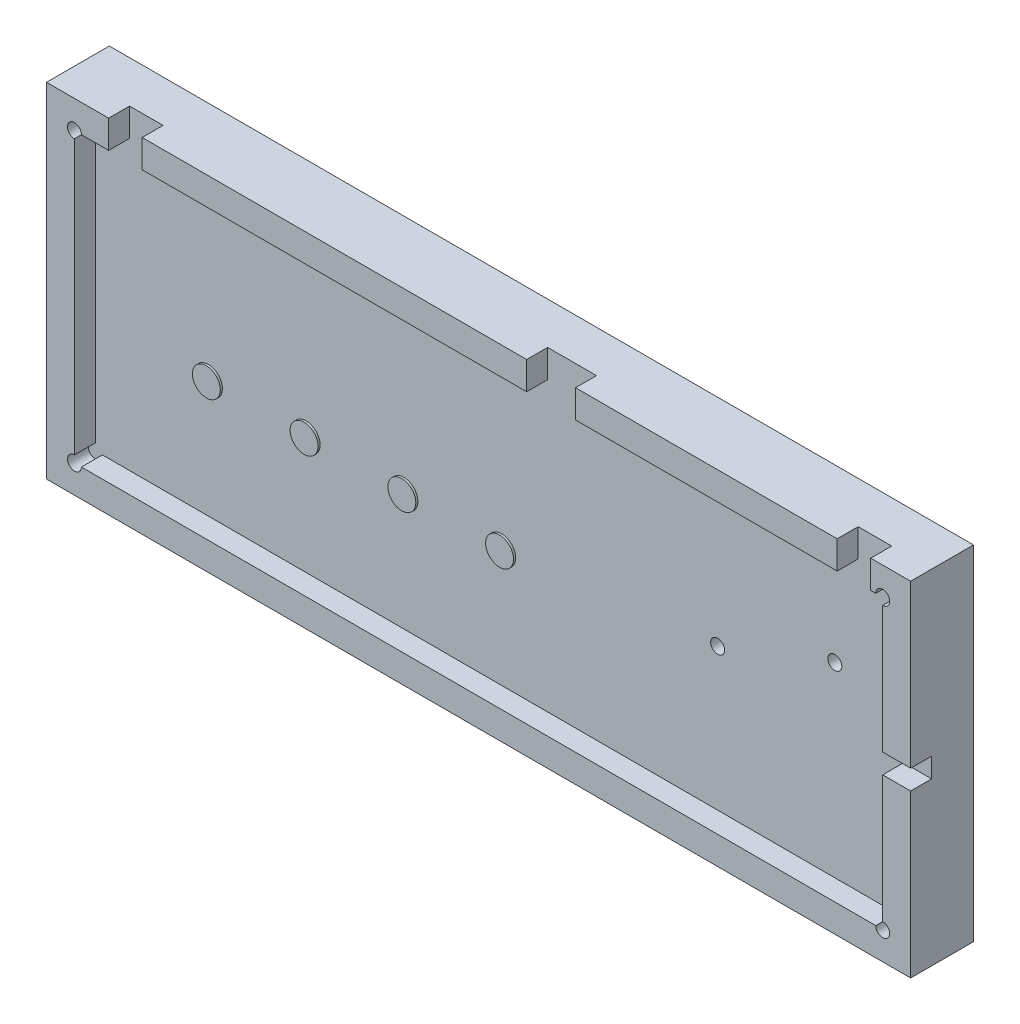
ISO-10303-21;
HEADER;
FILE_DESCRIPTION(('STEP AP214'),'2;1');
FILE_NAME('part.step','',(''),(''),'','','');
FILE_SCHEMA(('AUTOMOTIVE_DESIGN { 1 0 10303 214 1 1 1 1 }'));
ENDSEC;
DATA;
#1=APPLICATION_CONTEXT('core data for automotive mechanical design processes');
#2=APPLICATION_PROTOCOL_DEFINITION('international standard','automotive_design',2000,#1);
#3=PRODUCT_CONTEXT('',#1,'mechanical');
#4=PRODUCT('Part','Part','',(#3));
#5=PRODUCT_RELATED_PRODUCT_CATEGORY('part','',(#4));
#6=PRODUCT_DEFINITION_FORMATION('','',#4);
#7=PRODUCT_DEFINITION_CONTEXT('part definition',#1,'design');
#8=PRODUCT_DEFINITION('design','',#6,#7);
#9=PRODUCT_DEFINITION_SHAPE('','',#8);
#10=(LENGTH_UNIT() NAMED_UNIT(*) SI_UNIT(.MILLI.,.METRE.));
#11=(NAMED_UNIT(*) PLANE_ANGLE_UNIT() SI_UNIT($,.RADIAN.));
#12=(NAMED_UNIT(*) SI_UNIT($,.STERADIAN.) SOLID_ANGLE_UNIT());
#13=UNCERTAINTY_MEASURE_WITH_UNIT(LENGTH_MEASURE(1.E-05),#10,'distance_accuracy_value','');
#14=(GEOMETRIC_REPRESENTATION_CONTEXT(3) GLOBAL_UNCERTAINTY_ASSIGNED_CONTEXT((#13)) GLOBAL_UNIT_ASSIGNED_CONTEXT((#10,
#11,#12)) REPRESENTATION_CONTEXT('',''));
#15=CARTESIAN_POINT('',(0.,0.,0.));
#16=DIRECTION('',(0.,0.,1.));
#17=DIRECTION('',(1.,0.,0.));
#18=AXIS2_PLACEMENT_3D('',#15,#16,#17);
#19=CARTESIAN_POINT('',(0.,61.02,5.));
#20=DIRECTION('',(0.,0.,-1.));
#21=DIRECTION('',(-1.,0.,0.));
#22=AXIS2_PLACEMENT_3D('',#19,#20,#21);
#23=PLANE('',#22);
#24=DIRECTION('',(-1.,0.,0.));
#25=VECTOR('',#24,1.);
#26=CARTESIAN_POINT('',(9.9,51.12,5.));
#27=LINE('',#26,#25);
#28=CARTESIAN_POINT('',(74.67,51.12,5.));
#29=VERTEX_POINT('',#28);
#30=CARTESIAN_POINT('',(19.6,51.12,4.99999999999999));
#31=VERTEX_POINT('',#30);
#32=EDGE_CURVE('E233',#29,#31,#27,.T.);
#33=ORIENTED_EDGE('',*,*,#32,.F.);
#34=DIRECTION('',(0.,-1.,0.));
#35=VECTOR('',#34,1.);
#36=CARTESIAN_POINT('',(74.67,55.12,5.));
#37=LINE('',#36,#35);
#38=CARTESIAN_POINT('',(74.67,55.12,5.));
#39=VERTEX_POINT('',#38);
#40=EDGE_CURVE('E218',#39,#29,#37,.T.);
#41=ORIENTED_EDGE('',*,*,#40,.F.);
#42=DIRECTION('',(-1.,0.,0.));
#43=VECTOR('',#42,1.);
#44=CARTESIAN_POINT('',(5.9,55.12,5.));
#45=LINE('',#44,#43);
#46=CARTESIAN_POINT('',(19.6,55.12,5.));
#47=VERTEX_POINT('',#46);
#48=EDGE_CURVE('E329',#39,#47,#45,.T.);
#49=ORIENTED_EDGE('',*,*,#48,.T.);
#50=DIRECTION('',(0.,1.,0.));
#51=VECTOR('',#50,1.);
#52=CARTESIAN_POINT('',(19.6,-0.001000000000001,4.99999999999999));
#53=LINE('',#52,#51);
#54=EDGE_CURVE('E240',#31,#47,#53,.T.);
#55=ORIENTED_EDGE('',*,*,#54,.F.);
#56=EDGE_LOOP('',(#33,#41,#49,#55));
#57=FACE_BOUND('',#56,.T.);
#58=ADVANCED_FACE('F33',(#57),#23,.F.);
#59=CARTESIAN_POINT('',(9.9,51.12,2.));
#60=DIRECTION('',(0.,1.,0.));
#61=DIRECTION('',(-1.,0.,0.));
#62=AXIS2_PLACEMENT_3D('',#59,#60,#61);
#63=PLANE('',#62);
#64=DIRECTION('',(-1.,0.,0.));
#65=VECTOR('',#64,1.);
#66=CARTESIAN_POINT('',(77.09,51.12,2.));
#67=LINE('',#66,#65);
#68=CARTESIAN_POINT('',(74.67,51.12,2.));
#69=VERTEX_POINT('',#68);
#70=CARTESIAN_POINT('',(19.6,51.12,2.));
#71=VERTEX_POINT('',#70);
#72=EDGE_CURVE('E235',#69,#71,#67,.T.);
#73=ORIENTED_EDGE('',*,*,#72,.F.);
#74=DIRECTION('',(0.,0.,1.));
#75=VECTOR('',#74,1.);
#76=CARTESIAN_POINT('',(74.67,51.12,-6.06225774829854));
#77=LINE('',#76,#75);
#78=EDGE_CURVE('E221',#69,#29,#77,.T.);
#79=ORIENTED_EDGE('',*,*,#78,.T.);
#80=ORIENTED_EDGE('',*,*,#32,.T.);
#81=DIRECTION('',(0.,0.,1.));
#82=VECTOR('',#81,1.);
#83=CARTESIAN_POINT('',(19.6,51.12,1.99999999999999));
#84=LINE('',#83,#82);
#85=EDGE_CURVE('E481',#71,#31,#84,.T.);
#86=ORIENTED_EDGE('',*,*,#85,.F.);
#87=EDGE_LOOP('',(#73,#79,#80,#86));
#88=FACE_BOUND('',#87,.T.);
#89=ADVANCED_FACE('F231',(#88),#63,.F.);
#90=CARTESIAN_POINT('',(9.90000000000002,51.12,2.));
#91=DIRECTION('',(0.,0.,1.));
#92=DIRECTION('',(1.,0.,0.));
#93=AXIS2_PLACEMENT_3D('',#90,#91,#92);
#94=PLANE('',#93);
#95=CARTESIAN_POINT('',(26.0900000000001,26.7099999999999,2.));
#96=DIRECTION('',(0.,0.,1.));
#97=DIRECTION('',(1.,0.,0.));
#98=AXIS2_PLACEMENT_3D('',#95,#96,#97);
#99=CIRCLE('',#98,2.);
#100=CARTESIAN_POINT('',(28.0900000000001,26.7099999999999,2.));
#101=VERTEX_POINT('',#100);
#102=EDGE_CURVE('E374',#101,#101,#99,.T.);
#103=ORIENTED_EDGE('',*,*,#102,.F.);
#104=EDGE_LOOP('',(#103));
#105=FACE_BOUND('',#104,.T.);
#106=CARTESIAN_POINT('',(99.0221835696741,30.2259299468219,2.));
#107=DIRECTION('',(0.,0.,1.));
#108=DIRECTION('',(1.,0.,0.));
#109=AXIS2_PLACEMENT_3D('',#106,#107,#108);
#110=CIRCLE('',#109,0.999999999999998);
#111=CARTESIAN_POINT('',(100.022183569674,30.2259299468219,2.));
#112=VERTEX_POINT('',#111);
#113=EDGE_CURVE('E497',#112,#112,#110,.T.);
#114=ORIENTED_EDGE('',*,*,#113,.F.);
#115=EDGE_LOOP('',(#114));
#116=FACE_BOUND('',#115,.T.);
#117=CARTESIAN_POINT('',(115.807475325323,36.6118460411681,2.));
#118=DIRECTION('',(0.,0.,1.));
#119=DIRECTION('',(1.,0.,0.));
#120=AXIS2_PLACEMENT_3D('',#117,#118,#119);
#121=CIRCLE('',#120,0.999999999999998);
#122=CARTESIAN_POINT('',(116.807475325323,36.6118460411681,2.));
#123=VERTEX_POINT('',#122);
#124=EDGE_CURVE('E491',#123,#123,#121,.T.);
#125=ORIENTED_EDGE('',*,*,#124,.F.);
#126=EDGE_LOOP('',(#125));
#127=FACE_BOUND('',#126,.T.);
#128=DIRECTION('',(0.,1.,0.));
#129=VECTOR('',#128,1.);
#130=CARTESIAN_POINT('',(123.95,-0.001000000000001,2.00000000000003));
#131=LINE('',#130,#129);
#132=CARTESIAN_POINT('',(123.95,51.12,2.00000000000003));
#133=VERTEX_POINT('',#132);
#134=CARTESIAN_POINT('',(123.95,55.12,2.00000000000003));
#135=VERTEX_POINT('',#134);
#136=EDGE_CURVE('E470',#133,#135,#131,.T.);
#137=ORIENTED_EDGE('',*,*,#136,.T.);
#138=DIRECTION('',(-1.,0.,0.));
#139=VECTOR('',#138,1.);
#140=CARTESIAN_POINT('',(9.90000000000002,55.12,2.));
#141=LINE('',#140,#139);
#142=CARTESIAN_POINT('',(119.15,55.12,2.));
#143=VERTEX_POINT('',#142);
#144=EDGE_CURVE('E557',#135,#143,#141,.T.);
#145=ORIENTED_EDGE('',*,*,#144,.T.);
#146=DIRECTION('',(0.,1.,0.));
#147=VECTOR('',#146,1.);
#148=CARTESIAN_POINT('',(119.15,-0.001000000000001,2.00000000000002));
#149=LINE('',#148,#147);
#150=CARTESIAN_POINT('',(119.15,51.12,2.));
#151=VERTEX_POINT('',#150);
#152=EDGE_CURVE('E405',#151,#143,#149,.T.);
#153=ORIENTED_EDGE('',*,*,#152,.F.);
#154=CARTESIAN_POINT('',(81.67,51.12,2.));
#155=VERTEX_POINT('',#154);
#156=EDGE_CURVE('E272',#151,#155,#67,.T.);
#157=ORIENTED_EDGE('',*,*,#156,.T.);
#158=DIRECTION('',(0.,-1.,0.));
#159=VECTOR('',#158,1.);
#160=CARTESIAN_POINT('',(81.67,55.12,2.));
#161=LINE('',#160,#159);
#162=CARTESIAN_POINT('',(81.67,55.12,2.));
#163=VERTEX_POINT('',#162);
#164=EDGE_CURVE('E387',#163,#155,#161,.T.);
#165=ORIENTED_EDGE('',*,*,#164,.F.);
#166=DIRECTION('',(1.,0.,0.));
#167=VECTOR('',#166,1.);
#168=CARTESIAN_POINT('',(74.67,55.12,2.));
#169=LINE('',#168,#167);
#170=CARTESIAN_POINT('',(74.67,55.12,2.));
#171=VERTEX_POINT('',#170);
#172=EDGE_CURVE('E390',#171,#163,#169,.T.);
#173=ORIENTED_EDGE('',*,*,#172,.F.);
#174=DIRECTION('',(0.,1.,0.));
#175=VECTOR('',#174,1.);
#176=CARTESIAN_POINT('',(74.67,55.12,2.));
#177=LINE('',#176,#175);
#178=EDGE_CURVE('E382',#69,#171,#177,.T.);
#179=ORIENTED_EDGE('',*,*,#178,.F.);
#180=ORIENTED_EDGE('',*,*,#72,.T.);
#181=DIRECTION('',(0.,1.,0.));
#182=VECTOR('',#181,1.);
#183=CARTESIAN_POINT('',(19.6,-0.001000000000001,1.99999999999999));
#184=LINE('',#183,#182);
#185=CARTESIAN_POINT('',(19.6,55.12,2.));
#186=VERTEX_POINT('',#185);
#187=EDGE_CURVE('E483',#71,#186,#184,.T.);
#188=ORIENTED_EDGE('',*,*,#187,.T.);
#189=CARTESIAN_POINT('',(14.8,55.12,1.99999999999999));
#190=VERTEX_POINT('',#189);
#191=EDGE_CURVE('E559',#186,#190,#141,.T.);
#192=ORIENTED_EDGE('',*,*,#191,.T.);
#193=DIRECTION('',(0.,1.,0.));
#194=VECTOR('',#193,1.);
#195=CARTESIAN_POINT('',(14.8,-0.001000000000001,1.99999999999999));
#196=LINE('',#195,#194);
#197=CARTESIAN_POINT('',(14.8,51.12,2.));
#198=VERTEX_POINT('',#197);
#199=EDGE_CURVE('E412',#198,#190,#196,.T.);
#200=ORIENTED_EDGE('',*,*,#199,.F.);
#201=CARTESIAN_POINT('',(10.9,51.12,2.));
#202=VERTEX_POINT('',#201);
#203=EDGE_CURVE('E267',#198,#202,#67,.T.);
#204=ORIENTED_EDGE('',*,*,#203,.T.);
#205=CARTESIAN_POINT('',(9.9,51.12,2.));
#206=DIRECTION('',(0.,0.,1.));
#207=DIRECTION('',(1.,0.,0.));
#208=AXIS2_PLACEMENT_3D('',#205,#206,#207);
#209=CIRCLE('',#208,1.);
#210=CARTESIAN_POINT('',(9.9,50.12,2.));
#211=VERTEX_POINT('',#210);
#212=EDGE_CURVE('E409',#211,#202,#209,.F.);
#213=ORIENTED_EDGE('',*,*,#212,.F.);
#214=DIRECTION('',(0.,-1.,0.));
#215=VECTOR('',#214,1.);
#216=CARTESIAN_POINT('',(9.9,51.12,2.));
#217=LINE('',#216,#215);
#218=CARTESIAN_POINT('',(9.9,10.9,2.));
#219=VERTEX_POINT('',#218);
#220=EDGE_CURVE('E250',#211,#219,#217,.T.);
#221=ORIENTED_EDGE('',*,*,#220,.T.);
#222=CARTESIAN_POINT('',(9.9,9.9,2.));
#223=DIRECTION('',(0.,0.,1.));
#224=DIRECTION('',(1.,0.,0.));
#225=AXIS2_PLACEMENT_3D('',#222,#223,#224);
#226=CIRCLE('',#225,0.999999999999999);
#227=CARTESIAN_POINT('',(10.9,9.9,2.));
#228=VERTEX_POINT('',#227);
#229=EDGE_CURVE('E513',#228,#219,#226,.F.);
#230=ORIENTED_EDGE('',*,*,#229,.F.);
#231=DIRECTION('',(1.,0.,0.));
#232=VECTOR('',#231,1.);
#233=CARTESIAN_POINT('',(9.9,9.9,2.));
#234=LINE('',#233,#232);
#235=CARTESIAN_POINT('',(124.67,9.9,2.));
#236=VERTEX_POINT('',#235);
#237=EDGE_CURVE('E256',#228,#236,#234,.T.);
#238=ORIENTED_EDGE('',*,*,#237,.T.);
#239=CARTESIAN_POINT('',(125.67,9.9,2.));
#240=DIRECTION('',(0.,0.,1.));
#241=DIRECTION('',(1.,0.,0.));
#242=AXIS2_PLACEMENT_3D('',#239,#240,#241);
#243=CIRCLE('',#242,0.999999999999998);
#244=CARTESIAN_POINT('',(125.67,10.9,2.));
#245=VERTEX_POINT('',#244);
#246=EDGE_CURVE('E504',#245,#236,#243,.F.);
#247=ORIENTED_EDGE('',*,*,#246,.F.);
#248=DIRECTION('',(0.,1.,0.));
#249=VECTOR('',#248,1.);
#250=CARTESIAN_POINT('',(125.67,51.12,2.));
#251=LINE('',#250,#249);
#252=CARTESIAN_POINT('',(125.67,29.0976894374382,2.));
#253=VERTEX_POINT('',#252);
#254=EDGE_CURVE('E264',#245,#253,#251,.T.);
#255=ORIENTED_EDGE('',*,*,#254,.T.);
#256=DIRECTION('',(1.,0.,0.));
#257=VECTOR('',#256,1.);
#258=CARTESIAN_POINT('',(-0.001000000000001,29.0976894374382,2.));
#259=LINE('',#258,#257);
#260=CARTESIAN_POINT('',(129.67,29.0976894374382,2.));
#261=VERTEX_POINT('',#260);
#262=EDGE_CURVE('E539',#253,#261,#259,.T.);
#263=ORIENTED_EDGE('',*,*,#262,.T.);
#264=DIRECTION('',(0.,1.,0.));
#265=VECTOR('',#264,1.);
#266=CARTESIAN_POINT('',(129.67,51.12,2.));
#267=LINE('',#266,#265);
#268=CARTESIAN_POINT('',(129.67,31.9223105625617,2.));
#269=VERTEX_POINT('',#268);
#270=EDGE_CURVE('E564',#261,#269,#267,.T.);
#271=ORIENTED_EDGE('',*,*,#270,.T.);
#272=DIRECTION('',(1.,0.,0.));
#273=VECTOR('',#272,1.);
#274=CARTESIAN_POINT('',(-0.001000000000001,31.9223105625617,2.));
#275=LINE('',#274,#273);
#276=CARTESIAN_POINT('',(125.67,31.9223105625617,2.));
#277=VERTEX_POINT('',#276);
#278=EDGE_CURVE('E541',#277,#269,#275,.T.);
#279=ORIENTED_EDGE('',*,*,#278,.F.);
#280=CARTESIAN_POINT('',(125.67,50.12,2.));
#281=VERTEX_POINT('',#280);
#282=EDGE_CURVE('E261',#277,#281,#251,.T.);
#283=ORIENTED_EDGE('',*,*,#282,.T.);
#284=CARTESIAN_POINT('',(125.67,51.12,2.));
#285=DIRECTION('',(0.,0.,1.));
#286=DIRECTION('',(1.,0.,0.));
#287=AXIS2_PLACEMENT_3D('',#284,#285,#286);
#288=CIRCLE('',#287,0.999999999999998);
#289=CARTESIAN_POINT('',(124.67,51.12,2.));
#290=VERTEX_POINT('',#289);
#291=EDGE_CURVE('E432',#290,#281,#288,.F.);
#292=ORIENTED_EDGE('',*,*,#291,.F.);
#293=EDGE_CURVE('E268',#290,#133,#67,.T.);
#294=ORIENTED_EDGE('',*,*,#293,.T.);
#295=EDGE_LOOP('',(#137,#145,#153,#157,#165,#173,#179,#180,#188,#192,#200,#204,#213,#221,#230,
#238,#247,#255,#263,#271,#279,#283,#292,#294));
#296=FACE_BOUND('',#295,.T.);
#297=CARTESIAN_POINT('',(40.0900000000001,26.7099999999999,2.));
#298=DIRECTION('',(0.,0.,1.));
#299=DIRECTION('',(1.,0.,0.));
#300=AXIS2_PLACEMENT_3D('',#297,#298,#299);
#301=CIRCLE('',#300,2.);
#302=CARTESIAN_POINT('',(42.0900000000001,26.7099999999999,2.));
#303=VERTEX_POINT('',#302);
#304=EDGE_CURVE('E380',#303,#303,#301,.T.);
#305=ORIENTED_EDGE('',*,*,#304,.F.);
#306=EDGE_LOOP('',(#305));
#307=FACE_BOUND('',#306,.T.);
#308=CARTESIAN_POINT('',(54.0900000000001,26.7099999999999,2.));
#309=DIRECTION('',(0.,0.,1.));
#310=DIRECTION('',(1.,0.,0.));
#311=AXIS2_PLACEMENT_3D('',#308,#309,#310);
#312=CIRCLE('',#311,2.);
#313=CARTESIAN_POINT('',(56.0900000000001,26.7099999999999,2.));
#314=VERTEX_POINT('',#313);
#315=EDGE_CURVE('E279',#314,#314,#312,.T.);
#316=ORIENTED_EDGE('',*,*,#315,.F.);
#317=EDGE_LOOP('',(#316));
#318=FACE_BOUND('',#317,.T.);
#319=CARTESIAN_POINT('',(68.0900000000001,26.7099999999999,2.));
#320=DIRECTION('',(0.,0.,1.));
#321=DIRECTION('',(1.,0.,0.));
#322=AXIS2_PLACEMENT_3D('',#319,#320,#321);
#323=CIRCLE('',#322,2.);
#324=CARTESIAN_POINT('',(70.0900000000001,26.7099999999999,2.));
#325=VERTEX_POINT('',#324);
#326=EDGE_CURVE('E41',#325,#325,#323,.T.);
#327=ORIENTED_EDGE('',*,*,#326,.F.);
#328=EDGE_LOOP('',(#327));
#329=FACE_BOUND('',#328,.T.);
#330=ADVANCED_FACE('F289',(#105,#116,#127,#296,#307,#318,#329),#94,.T.);
#331=CARTESIAN_POINT('',(14.8,55.12,5.));
#332=VERTEX_POINT('',#331);
#333=CARTESIAN_POINT('',(5.9,55.12,5.));
#334=VERTEX_POINT('',#333);
#335=EDGE_CURVE('E331',#332,#334,#45,.T.);
#336=ORIENTED_EDGE('',*,*,#335,.T.);
#337=DIRECTION('',(0.,-1.,0.));
#338=VECTOR('',#337,1.);
#339=CARTESIAN_POINT('',(5.9,55.12,5.));
#340=LINE('',#339,#338);
#341=CARTESIAN_POINT('',(5.90000000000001,5.9,5.));
#342=VERTEX_POINT('',#341);
#343=EDGE_CURVE('E348',#334,#342,#340,.T.);
#344=ORIENTED_EDGE('',*,*,#343,.T.);
#345=DIRECTION('',(1.,0.,0.));
#346=VECTOR('',#345,1.);
#347=CARTESIAN_POINT('',(5.90000000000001,5.9,5.));
#348=LINE('',#347,#346);
#349=CARTESIAN_POINT('',(129.67,5.9,5.));
#350=VERTEX_POINT('',#349);
#351=EDGE_CURVE('E345',#342,#350,#348,.T.);
#352=ORIENTED_EDGE('',*,*,#351,.T.);
#353=DIRECTION('',(0.,1.,0.));
#354=VECTOR('',#353,1.);
#355=CARTESIAN_POINT('',(129.67,55.12,5.));
#356=LINE('',#355,#354);
#357=CARTESIAN_POINT('',(129.67,29.0976894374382,5.));
#358=VERTEX_POINT('',#357);
#359=EDGE_CURVE('E337',#350,#358,#356,.T.);
#360=ORIENTED_EDGE('',*,*,#359,.T.);
#361=DIRECTION('',(1.,0.,0.));
#362=VECTOR('',#361,1.);
#363=CARTESIAN_POINT('',(-0.001000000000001,29.0976894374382,5.));
#364=LINE('',#363,#362);
#365=CARTESIAN_POINT('',(125.67,29.0976894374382,5.));
#366=VERTEX_POINT('',#365);
#367=EDGE_CURVE('E478',#366,#358,#364,.T.);
#368=ORIENTED_EDGE('',*,*,#367,.F.);
#369=DIRECTION('',(0.,1.,0.));
#370=VECTOR('',#369,1.);
#371=CARTESIAN_POINT('',(125.67,51.12,5.));
#372=LINE('',#371,#370);
#373=CARTESIAN_POINT('',(125.67,10.9,5.));
#374=VERTEX_POINT('',#373);
#375=EDGE_CURVE('E246',#374,#366,#372,.T.);
#376=ORIENTED_EDGE('',*,*,#375,.F.);
#377=CARTESIAN_POINT('',(125.67,9.9,5.));
#378=DIRECTION('',(0.,0.,1.));
#379=DIRECTION('',(1.,0.,0.));
#380=AXIS2_PLACEMENT_3D('',#377,#378,#379);
#381=CIRCLE('',#380,0.999999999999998);
#382=CARTESIAN_POINT('',(124.67,9.9,5.));
#383=VERTEX_POINT('',#382);
#384=EDGE_CURVE('E500',#383,#374,#381,.T.);
#385=ORIENTED_EDGE('',*,*,#384,.F.);
#386=DIRECTION('',(1.,0.,0.));
#387=VECTOR('',#386,1.);
#388=CARTESIAN_POINT('',(77.09,9.9,5.));
#389=LINE('',#388,#387);
#390=CARTESIAN_POINT('',(10.9,9.9,5.));
#391=VERTEX_POINT('',#390);
#392=EDGE_CURVE('E443',#391,#383,#389,.T.);
#393=ORIENTED_EDGE('',*,*,#392,.F.);
#394=CARTESIAN_POINT('',(9.9,9.9,5.));
#395=DIRECTION('',(0.,0.,1.));
#396=DIRECTION('',(1.,0.,0.));
#397=AXIS2_PLACEMENT_3D('',#394,#395,#396);
#398=CIRCLE('',#397,0.999999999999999);
#399=CARTESIAN_POINT('',(9.9,10.9,5.));
#400=VERTEX_POINT('',#399);
#401=EDGE_CURVE('E511',#400,#391,#398,.T.);
#402=ORIENTED_EDGE('',*,*,#401,.F.);
#403=DIRECTION('',(0.,-1.,0.));
#404=VECTOR('',#403,1.);
#405=CARTESIAN_POINT('',(9.9,51.12,5.));
#406=LINE('',#405,#404);
#407=CARTESIAN_POINT('',(9.9,50.12,5.));
#408=VERTEX_POINT('',#407);
#409=EDGE_CURVE('E440',#408,#400,#406,.T.);
#410=ORIENTED_EDGE('',*,*,#409,.F.);
#411=CARTESIAN_POINT('',(9.9,51.12,5.));
#412=DIRECTION('',(0.,0.,1.));
#413=DIRECTION('',(1.,0.,0.));
#414=AXIS2_PLACEMENT_3D('',#411,#412,#413);
#415=CIRCLE('',#414,1.);
#416=CARTESIAN_POINT('',(10.9,51.12,5.));
#417=VERTEX_POINT('',#416);
#418=EDGE_CURVE('E423',#417,#408,#415,.T.);
#419=ORIENTED_EDGE('',*,*,#418,.F.);
#420=CARTESIAN_POINT('',(14.8,51.12,4.99999999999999));
#421=VERTEX_POINT('',#420);
#422=EDGE_CURVE('E242',#421,#417,#27,.T.);
#423=ORIENTED_EDGE('',*,*,#422,.F.);
#424=DIRECTION('',(0.,1.,0.));
#425=VECTOR('',#424,1.);
#426=CARTESIAN_POINT('',(14.8,-0.001000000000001,4.99999999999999));
#427=LINE('',#426,#425);
#428=EDGE_CURVE('E486',#421,#332,#427,.T.);
#429=ORIENTED_EDGE('',*,*,#428,.T.);
#430=EDGE_LOOP('',(#336,#344,#352,#360,#368,#376,#385,#393,#402,#410,#419,#423,#429));
#431=FACE_BOUND('',#430,.T.);
#432=ADVANCED_FACE('F291',(#431),#23,.F.);
#433=CARTESIAN_POINT('',(119.15,55.12,5.));
#434=VERTEX_POINT('',#433);
#435=CARTESIAN_POINT('',(81.67,55.12,5.));
#436=VERTEX_POINT('',#435);
#437=EDGE_CURVE('E323',#434,#436,#45,.T.);
#438=ORIENTED_EDGE('',*,*,#437,.T.);
#439=DIRECTION('',(0.,1.,0.));
#440=VECTOR('',#439,1.);
#441=CARTESIAN_POINT('',(81.67,55.12,5.));
#442=LINE('',#441,#440);
#443=CARTESIAN_POINT('',(81.67,51.12,5.));
#444=VERTEX_POINT('',#443);
#445=EDGE_CURVE('E228',#444,#436,#442,.T.);
#446=ORIENTED_EDGE('',*,*,#445,.F.);
#447=CARTESIAN_POINT('',(119.15,51.12,5.));
#448=VERTEX_POINT('',#447);
#449=EDGE_CURVE('E241',#448,#444,#27,.T.);
#450=ORIENTED_EDGE('',*,*,#449,.F.);
#451=DIRECTION('',(0.,1.,0.));
#452=VECTOR('',#451,1.);
#453=CARTESIAN_POINT('',(119.15,-0.001000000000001,5.00000000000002));
#454=LINE('',#453,#452);
#455=EDGE_CURVE('E325',#448,#434,#454,.T.);
#456=ORIENTED_EDGE('',*,*,#455,.T.);
#457=EDGE_LOOP('',(#438,#446,#450,#456));
#458=FACE_BOUND('',#457,.T.);
#459=ADVANCED_FACE('F298',(#458),#23,.F.);
#460=CARTESIAN_POINT('',(129.67,55.12,5.));
#461=VERTEX_POINT('',#460);
#462=CARTESIAN_POINT('',(123.95,55.12,5.));
#463=VERTEX_POINT('',#462);
#464=EDGE_CURVE('E328',#461,#463,#45,.T.);
#465=ORIENTED_EDGE('',*,*,#464,.T.);
#466=DIRECTION('',(0.,1.,0.));
#467=VECTOR('',#466,1.);
#468=CARTESIAN_POINT('',(123.95,-0.001000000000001,5.00000000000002));
#469=LINE('',#468,#467);
#470=CARTESIAN_POINT('',(123.95,51.12,5.00000000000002));
#471=VERTEX_POINT('',#470);
#472=EDGE_CURVE('E465',#471,#463,#469,.T.);
#473=ORIENTED_EDGE('',*,*,#472,.F.);
#474=CARTESIAN_POINT('',(124.67,51.12,5.));
#475=VERTEX_POINT('',#474);
#476=EDGE_CURVE('E244',#475,#471,#27,.T.);
#477=ORIENTED_EDGE('',*,*,#476,.F.);
#478=CARTESIAN_POINT('',(125.67,51.12,5.));
#479=DIRECTION('',(0.,0.,1.));
#480=DIRECTION('',(1.,0.,0.));
#481=AXIS2_PLACEMENT_3D('',#478,#479,#480);
#482=CIRCLE('',#481,0.999999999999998);
#483=CARTESIAN_POINT('',(125.67,50.12,5.));
#484=VERTEX_POINT('',#483);
#485=EDGE_CURVE('E427',#484,#475,#482,.T.);
#486=ORIENTED_EDGE('',*,*,#485,.F.);
#487=CARTESIAN_POINT('',(125.67,31.9223105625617,5.));
#488=VERTEX_POINT('',#487);
#489=EDGE_CURVE('E445',#488,#484,#372,.T.);
#490=ORIENTED_EDGE('',*,*,#489,.F.);
#491=DIRECTION('',(1.,0.,0.));
#492=VECTOR('',#491,1.);
#493=CARTESIAN_POINT('',(-0.001000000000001,31.9223105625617,5.));
#494=LINE('',#493,#492);
#495=CARTESIAN_POINT('',(129.67,31.9223105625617,5.));
#496=VERTEX_POINT('',#495);
#497=EDGE_CURVE('E548',#488,#496,#494,.T.);
#498=ORIENTED_EDGE('',*,*,#497,.T.);
#499=EDGE_CURVE('E56',#496,#461,#356,.T.);
#500=ORIENTED_EDGE('',*,*,#499,.T.);
#501=EDGE_LOOP('',(#465,#473,#477,#486,#490,#498,#500));
#502=FACE_BOUND('',#501,.T.);
#503=ADVANCED_FACE('F301',(#502),#23,.F.);
#504=CARTESIAN_POINT('',(0.,61.02,0.));
#505=DIRECTION('',(0.,0.,-1.));
#506=DIRECTION('',(-1.,0.,0.));
#507=AXIS2_PLACEMENT_3D('',#504,#505,#506);
#508=PLANE('',#507);
#509=CARTESIAN_POINT('',(99.0221835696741,30.2259299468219,0.));
#510=DIRECTION('',(0.,0.,-1.));
#511=DIRECTION('',(-1.,0.,0.));
#512=AXIS2_PLACEMENT_3D('',#509,#510,#511);
#513=CIRCLE('',#512,1.07500000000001);
#514=CARTESIAN_POINT('',(97.9471835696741,30.2259299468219,0.));
#515=VERTEX_POINT('',#514);
#516=EDGE_CURVE('E276',#515,#515,#513,.F.);
#517=ORIENTED_EDGE('',*,*,#516,.F.);
#518=EDGE_LOOP('',(#517));
#519=FACE_BOUND('',#518,.T.);
#520=CARTESIAN_POINT('',(99.0221835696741,30.2259299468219,0.));
#521=DIRECTION('',(0.,0.,-1.));
#522=DIRECTION('',(-1.,0.,0.));
#523=AXIS2_PLACEMENT_3D('',#520,#521,#522);
#524=CIRCLE('',#523,0.999999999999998);
#525=CARTESIAN_POINT('',(98.0221835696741,30.2259299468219,0.));
#526=VERTEX_POINT('',#525);
#527=EDGE_CURVE('E494',#526,#526,#524,.F.);
#528=ORIENTED_EDGE('',*,*,#527,.T.);
#529=EDGE_LOOP('',(#528));
#530=FACE_BOUND('',#529,.T.);
#531=ADVANCED_FACE('F318',(#519,#530),#508,.T.);
#532=CARTESIAN_POINT('',(19.6,-0.001000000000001,1.99999999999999));
#533=DIRECTION('',(1.,0.,0.));
#534=DIRECTION('',(0.,0.,-1.));
#535=AXIS2_PLACEMENT_3D('',#532,#533,#534);
#536=PLANE('',#535);
#537=DIRECTION('',(0.,0.,1.));
#538=VECTOR('',#537,1.);
#539=CARTESIAN_POINT('',(19.6,55.12,1.99999999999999));
#540=LINE('',#539,#538);
#541=EDGE_CURVE('E543',#186,#47,#540,.T.);
#542=ORIENTED_EDGE('',*,*,#541,.F.);
#543=ORIENTED_EDGE('',*,*,#187,.F.);
#544=ORIENTED_EDGE('',*,*,#85,.T.);
#545=ORIENTED_EDGE('',*,*,#54,.T.);
#546=EDGE_LOOP('',(#542,#543,#544,#545));
#547=FACE_BOUND('',#546,.T.);
#548=ADVANCED_FACE('F609',(#547),#536,.F.);
#549=CARTESIAN_POINT('',(14.8,-0.001000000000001,4.99999999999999));
#550=DIRECTION('',(-1.,0.,0.));
#551=DIRECTION('',(0.,0.,1.));
#552=AXIS2_PLACEMENT_3D('',#549,#550,#551);
#553=PLANE('',#552);
#554=DIRECTION('',(0.,0.,-1.));
#555=VECTOR('',#554,1.);
#556=CARTESIAN_POINT('',(14.8,55.12,4.99999999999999));
#557=LINE('',#556,#555);
#558=EDGE_CURVE('E556',#332,#190,#557,.T.);
#559=ORIENTED_EDGE('',*,*,#558,.F.);
#560=ORIENTED_EDGE('',*,*,#428,.F.);
#561=DIRECTION('',(0.,0.,-1.));
#562=VECTOR('',#561,1.);
#563=CARTESIAN_POINT('',(14.8,51.12,4.99999999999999));
#564=LINE('',#563,#562);
#565=EDGE_CURVE('E479',#421,#198,#564,.T.);
#566=ORIENTED_EDGE('',*,*,#565,.T.);
#567=ORIENTED_EDGE('',*,*,#199,.T.);
#568=EDGE_LOOP('',(#559,#560,#566,#567));
#569=FACE_BOUND('',#568,.T.);
#570=ADVANCED_FACE('F606',(#569),#553,.F.);
#571=CARTESIAN_POINT('',(119.15,-0.001000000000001,5.00000000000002));
#572=DIRECTION('',(-1.,0.,0.));
#573=DIRECTION('',(0.,0.,1.));
#574=AXIS2_PLACEMENT_3D('',#571,#572,#573);
#575=PLANE('',#574);
#576=DIRECTION('',(0.,0.,-1.));
#577=VECTOR('',#576,1.);
#578=CARTESIAN_POINT('',(119.15,55.12,5.00000000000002));
#579=LINE('',#578,#577);
#580=EDGE_CURVE('E555',#434,#143,#579,.T.);
#581=ORIENTED_EDGE('',*,*,#580,.F.);
#582=ORIENTED_EDGE('',*,*,#455,.F.);
#583=DIRECTION('',(0.,0.,-1.));
#584=VECTOR('',#583,1.);
#585=CARTESIAN_POINT('',(119.15,51.12,5.00000000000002));
#586=LINE('',#585,#584);
#587=EDGE_CURVE('E469',#448,#151,#586,.T.);
#588=ORIENTED_EDGE('',*,*,#587,.T.);
#589=ORIENTED_EDGE('',*,*,#152,.T.);
#590=EDGE_LOOP('',(#581,#582,#588,#589));
#591=FACE_BOUND('',#590,.T.);
#592=ADVANCED_FACE('F554',(#591),#575,.F.);
#593=CARTESIAN_POINT('',(123.95,-0.001000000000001,2.00000000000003));
#594=DIRECTION('',(1.,0.,0.));
#595=DIRECTION('',(0.,0.,-1.));
#596=AXIS2_PLACEMENT_3D('',#593,#594,#595);
#597=PLANE('',#596);
#598=DIRECTION('',(0.,0.,1.));
#599=VECTOR('',#598,1.);
#600=CARTESIAN_POINT('',(123.95,55.12,2.00000000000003));
#601=LINE('',#600,#599);
#602=EDGE_CURVE('E274',#135,#463,#601,.T.);
#603=ORIENTED_EDGE('',*,*,#602,.F.);
#604=ORIENTED_EDGE('',*,*,#136,.F.);
#605=DIRECTION('',(0.,0.,1.));
#606=VECTOR('',#605,1.);
#607=CARTESIAN_POINT('',(123.95,51.12,2.00000000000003));
#608=LINE('',#607,#606);
#609=EDGE_CURVE('E472',#133,#471,#608,.T.);
#610=ORIENTED_EDGE('',*,*,#609,.T.);
#611=ORIENTED_EDGE('',*,*,#472,.T.);
#612=EDGE_LOOP('',(#603,#604,#610,#611));
#613=FACE_BOUND('',#612,.T.);
#614=ADVANCED_FACE('F597',(#613),#597,.F.);
#615=CARTESIAN_POINT('',(-0.001000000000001,29.0976894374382,5.));
#616=DIRECTION('',(0.,-1.,0.));
#617=DIRECTION('',(0.,0.,-1.));
#618=AXIS2_PLACEMENT_3D('',#615,#616,#617);
#619=PLANE('',#618);
#620=DIRECTION('',(0.,0.,1.));
#621=VECTOR('',#620,1.);
#622=CARTESIAN_POINT('',(129.67,29.0976894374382,5.));
#623=LINE('',#622,#621);
#624=EDGE_CURVE('E560',#261,#358,#623,.T.);
#625=ORIENTED_EDGE('',*,*,#624,.F.);
#626=ORIENTED_EDGE('',*,*,#262,.F.);
#627=DIRECTION('',(0.,0.,1.));
#628=VECTOR('',#627,1.);
#629=CARTESIAN_POINT('',(125.67,29.0976894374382,5.));
#630=LINE('',#629,#628);
#631=EDGE_CURVE('E537',#253,#366,#630,.T.);
#632=ORIENTED_EDGE('',*,*,#631,.T.);
#633=ORIENTED_EDGE('',*,*,#367,.T.);
#634=EDGE_LOOP('',(#625,#626,#632,#633));
#635=FACE_BOUND('',#634,.T.);
#636=ADVANCED_FACE('F586',(#635),#619,.F.);
#637=CARTESIAN_POINT('',(-0.001000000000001,31.9223105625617,5.));
#638=DIRECTION('',(0.,1.,0.));
#639=DIRECTION('',(0.,0.,1.));
#640=AXIS2_PLACEMENT_3D('',#637,#638,#639);
#641=PLANE('',#640);
#642=DIRECTION('',(0.,0.,-1.));
#643=VECTOR('',#642,1.);
#644=CARTESIAN_POINT('',(129.67,31.9223105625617,5.));
#645=LINE('',#644,#643);
#646=EDGE_CURVE('E271',#496,#269,#645,.T.);
#647=ORIENTED_EDGE('',*,*,#646,.F.);
#648=ORIENTED_EDGE('',*,*,#497,.F.);
#649=DIRECTION('',(0.,0.,-1.));
#650=VECTOR('',#649,1.);
#651=CARTESIAN_POINT('',(125.67,31.9223105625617,5.));
#652=LINE('',#651,#650);
#653=EDGE_CURVE('E457',#488,#277,#652,.T.);
#654=ORIENTED_EDGE('',*,*,#653,.T.);
#655=ORIENTED_EDGE('',*,*,#278,.T.);
#656=EDGE_LOOP('',(#647,#648,#654,#655));
#657=FACE_BOUND('',#656,.T.);
#658=ADVANCED_FACE('F589',(#657),#641,.F.);
#659=CARTESIAN_POINT('',(125.67,51.12,2.));
#660=DIRECTION('',(1.,0.,0.));
#661=DIRECTION('',(0.,0.,-1.));
#662=AXIS2_PLACEMENT_3D('',#659,#660,#661);
#663=PLANE('',#662);
#664=ORIENTED_EDGE('',*,*,#375,.T.);
#665=ORIENTED_EDGE('',*,*,#631,.F.);
#666=ORIENTED_EDGE('',*,*,#254,.F.);
#667=DIRECTION('',(0.,0.,1.));
#668=VECTOR('',#667,1.);
#669=CARTESIAN_POINT('',(125.67,10.9,-0.828427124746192));
#670=LINE('',#669,#668);
#671=EDGE_CURVE('E509',#245,#374,#670,.T.);
#672=ORIENTED_EDGE('',*,*,#671,.T.);
#673=EDGE_LOOP('',(#664,#665,#666,#672));
#674=FACE_BOUND('',#673,.T.);
#675=ADVANCED_FACE('F536',(#674),#663,.F.);
#676=ORIENTED_EDGE('',*,*,#449,.T.);
#677=DIRECTION('',(0.,0.,1.));
#678=VECTOR('',#677,1.);
#679=CARTESIAN_POINT('',(81.67,51.12,-6.06225774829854));
#680=LINE('',#679,#678);
#681=EDGE_CURVE('E236',#155,#444,#680,.T.);
#682=ORIENTED_EDGE('',*,*,#681,.F.);
#683=ORIENTED_EDGE('',*,*,#156,.F.);
#684=ORIENTED_EDGE('',*,*,#587,.F.);
#685=EDGE_LOOP('',(#676,#682,#683,#684));
#686=FACE_BOUND('',#685,.T.);
#687=ADVANCED_FACE('F303',(#686),#63,.F.);
#688=ORIENTED_EDGE('',*,*,#476,.T.);
#689=ORIENTED_EDGE('',*,*,#609,.F.);
#690=ORIENTED_EDGE('',*,*,#293,.F.);
#691=DIRECTION('',(0.,0.,1.));
#692=VECTOR('',#691,1.);
#693=CARTESIAN_POINT('',(124.67,51.12,-0.828427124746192));
#694=LINE('',#693,#692);
#695=EDGE_CURVE('E438',#290,#475,#694,.T.);
#696=ORIENTED_EDGE('',*,*,#695,.T.);
#697=EDGE_LOOP('',(#688,#689,#690,#696));
#698=FACE_BOUND('',#697,.T.);
#699=ADVANCED_FACE('F638',(#698),#63,.F.);
#700=CARTESIAN_POINT('',(9.9,51.12,2.));
#701=DIRECTION('',(-1.,0.,0.));
#702=DIRECTION('',(0.,-1.,0.));
#703=AXIS2_PLACEMENT_3D('',#700,#701,#702);
#704=PLANE('',#703);
#705=ORIENTED_EDGE('',*,*,#409,.T.);
#706=DIRECTION('',(0.,0.,1.));
#707=VECTOR('',#706,1.);
#708=CARTESIAN_POINT('',(9.9,10.9,-0.828427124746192));
#709=LINE('',#708,#707);
#710=EDGE_CURVE('E518',#400,#219,#709,.F.);
#711=ORIENTED_EDGE('',*,*,#710,.T.);
#712=ORIENTED_EDGE('',*,*,#220,.F.);
#713=DIRECTION('',(0.,0.,1.));
#714=VECTOR('',#713,1.);
#715=CARTESIAN_POINT('',(9.9,50.12,-0.828427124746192));
#716=LINE('',#715,#714);
#717=EDGE_CURVE('E422',#211,#408,#716,.T.);
#718=ORIENTED_EDGE('',*,*,#717,.T.);
#719=EDGE_LOOP('',(#705,#711,#712,#718));
#720=FACE_BOUND('',#719,.T.);
#721=ADVANCED_FACE('F522',(#720),#704,.F.);
#722=ORIENTED_EDGE('',*,*,#203,.F.);
#723=ORIENTED_EDGE('',*,*,#565,.F.);
#724=ORIENTED_EDGE('',*,*,#422,.T.);
#725=DIRECTION('',(0.,0.,1.));
#726=VECTOR('',#725,1.);
#727=CARTESIAN_POINT('',(10.9,51.12,-0.828427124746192));
#728=LINE('',#727,#726);
#729=EDGE_CURVE('E419',#417,#202,#728,.F.);
#730=ORIENTED_EDGE('',*,*,#729,.T.);
#731=EDGE_LOOP('',(#722,#723,#724,#730));
#732=FACE_BOUND('',#731,.T.);
#733=ADVANCED_FACE('F304',(#732),#63,.F.);
#734=ORIENTED_EDGE('',*,*,#282,.F.);
#735=ORIENTED_EDGE('',*,*,#653,.F.);
#736=ORIENTED_EDGE('',*,*,#489,.T.);
#737=DIRECTION('',(0.,0.,1.));
#738=VECTOR('',#737,1.);
#739=CARTESIAN_POINT('',(125.67,50.12,-0.828427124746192));
#740=LINE('',#739,#738);
#741=EDGE_CURVE('E435',#484,#281,#740,.F.);
#742=ORIENTED_EDGE('',*,*,#741,.T.);
#743=EDGE_LOOP('',(#734,#735,#736,#742));
#744=FACE_BOUND('',#743,.T.);
#745=ADVANCED_FACE('F456',(#744),#663,.F.);
#746=CARTESIAN_POINT('',(77.09,9.9,2.));
#747=DIRECTION('',(0.,-1.,0.));
#748=DIRECTION('',(0.,0.,-1.));
#749=AXIS2_PLACEMENT_3D('',#746,#747,#748);
#750=PLANE('',#749);
#751=ORIENTED_EDGE('',*,*,#392,.T.);
#752=DIRECTION('',(0.,0.,1.));
#753=VECTOR('',#752,1.);
#754=CARTESIAN_POINT('',(124.67,9.9,-0.828427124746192));
#755=LINE('',#754,#753);
#756=EDGE_CURVE('E506',#383,#236,#755,.F.);
#757=ORIENTED_EDGE('',*,*,#756,.T.);
#758=ORIENTED_EDGE('',*,*,#237,.F.);
#759=DIRECTION('',(0.,0.,1.));
#760=VECTOR('',#759,1.);
#761=CARTESIAN_POINT('',(10.9,9.9,-0.828427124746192));
#762=LINE('',#761,#760);
#763=EDGE_CURVE('E515',#228,#391,#762,.T.);
#764=ORIENTED_EDGE('',*,*,#763,.T.);
#765=EDGE_LOOP('',(#751,#757,#758,#764));
#766=FACE_BOUND('',#765,.T.);
#767=ADVANCED_FACE('F531',(#766),#750,.F.);
#768=CARTESIAN_POINT('',(125.67,51.12,-0.828427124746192));
#769=DIRECTION('',(0.,0.,1.));
#770=DIRECTION('',(1.,0.,0.));
#771=AXIS2_PLACEMENT_3D('',#768,#769,#770);
#772=CYLINDRICAL_SURFACE('',#771,0.999999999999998);
#773=ORIENTED_EDGE('',*,*,#291,.T.);
#774=ORIENTED_EDGE('',*,*,#741,.F.);
#775=ORIENTED_EDGE('',*,*,#485,.T.);
#776=ORIENTED_EDGE('',*,*,#695,.F.);
#777=EDGE_LOOP('',(#773,#774,#775,#776));
#778=FACE_BOUND('',#777,.T.);
#779=ADVANCED_FACE('F461',(#778),#772,.F.);
#780=CARTESIAN_POINT('',(9.9,51.12,-0.828427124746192));
#781=DIRECTION('',(0.,0.,1.));
#782=DIRECTION('',(1.,0.,0.));
#783=AXIS2_PLACEMENT_3D('',#780,#781,#782);
#784=CYLINDRICAL_SURFACE('',#783,1.);
#785=ORIENTED_EDGE('',*,*,#212,.T.);
#786=ORIENTED_EDGE('',*,*,#729,.F.);
#787=ORIENTED_EDGE('',*,*,#418,.T.);
#788=ORIENTED_EDGE('',*,*,#717,.F.);
#789=EDGE_LOOP('',(#785,#786,#787,#788));
#790=FACE_BOUND('',#789,.T.);
#791=ADVANCED_FACE('F418',(#790),#784,.F.);
#792=CARTESIAN_POINT('',(9.9,9.9,-0.828427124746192));
#793=DIRECTION('',(0.,0.,1.));
#794=DIRECTION('',(1.,0.,0.));
#795=AXIS2_PLACEMENT_3D('',#792,#793,#794);
#796=CYLINDRICAL_SURFACE('',#795,0.999999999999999);
#797=ORIENTED_EDGE('',*,*,#401,.T.);
#798=ORIENTED_EDGE('',*,*,#763,.F.);
#799=ORIENTED_EDGE('',*,*,#229,.T.);
#800=ORIENTED_EDGE('',*,*,#710,.F.);
#801=EDGE_LOOP('',(#797,#798,#799,#800));
#802=FACE_BOUND('',#801,.T.);
#803=ADVANCED_FACE('F528',(#802),#796,.F.);
#804=CARTESIAN_POINT('',(125.67,9.9,-0.828427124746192));
#805=DIRECTION('',(0.,0.,1.));
#806=DIRECTION('',(1.,0.,0.));
#807=AXIS2_PLACEMENT_3D('',#804,#805,#806);
#808=CYLINDRICAL_SURFACE('',#807,0.999999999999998);
#809=ORIENTED_EDGE('',*,*,#246,.T.);
#810=ORIENTED_EDGE('',*,*,#756,.F.);
#811=ORIENTED_EDGE('',*,*,#384,.T.);
#812=ORIENTED_EDGE('',*,*,#671,.F.);
#813=EDGE_LOOP('',(#809,#810,#811,#812));
#814=FACE_BOUND('',#813,.T.);
#815=ADVANCED_FACE('F621',(#814),#808,.F.);
#816=CARTESIAN_POINT('',(99.0221835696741,30.2259299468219,-0.00100000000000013));
#817=DIRECTION('',(0.,0.,1.));
#818=DIRECTION('',(1.,0.,0.));
#819=AXIS2_PLACEMENT_3D('',#816,#817,#818);
#820=CYLINDRICAL_SURFACE('',#819,0.999999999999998);
#821=ORIENTED_EDGE('',*,*,#527,.F.);
#822=EDGE_LOOP('',(#821));
#823=FACE_BOUND('',#822,.T.);
#824=ORIENTED_EDGE('',*,*,#113,.T.);
#825=EDGE_LOOP('',(#824));
#826=FACE_BOUND('',#825,.T.);
#827=ADVANCED_FACE('F617',(#823,#826),#820,.F.);
#828=CARTESIAN_POINT('',(115.807475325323,36.6118460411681,-0.00100000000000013));
#829=DIRECTION('',(0.,0.,1.));
#830=DIRECTION('',(1.,0.,0.));
#831=AXIS2_PLACEMENT_3D('',#828,#829,#830);
#832=CYLINDRICAL_SURFACE('',#831,0.999999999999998);
#833=CARTESIAN_POINT('',(115.807475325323,36.6118460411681,0.));
#834=DIRECTION('',(0.,0.,-1.));
#835=DIRECTION('',(-1.,0.,0.));
#836=AXIS2_PLACEMENT_3D('',#833,#834,#835);
#837=CIRCLE('',#836,0.999999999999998);
#838=CARTESIAN_POINT('',(114.807475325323,36.6118460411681,0.));
#839=VERTEX_POINT('',#838);
#840=EDGE_CURVE('E485',#839,#839,#837,.F.);
#841=ORIENTED_EDGE('',*,*,#840,.F.);
#842=EDGE_LOOP('',(#841));
#843=FACE_BOUND('',#842,.T.);
#844=ORIENTED_EDGE('',*,*,#124,.T.);
#845=EDGE_LOOP('',(#844));
#846=FACE_BOUND('',#845,.T.);
#847=ADVANCED_FACE('F614',(#843,#846),#832,.F.);
#848=CARTESIAN_POINT('',(5.9,55.12,0.));
#849=DIRECTION('',(0.,1.,0.));
#850=DIRECTION('',(0.,0.,1.));
#851=AXIS2_PLACEMENT_3D('',#848,#849,#850);
#852=PLANE('',#851);
#853=DIRECTION('',(0.,0.,1.));
#854=VECTOR('',#853,1.);
#855=CARTESIAN_POINT('',(74.67,55.12,-6.06225774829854));
#856=LINE('',#855,#854);
#857=EDGE_CURVE('E224',#171,#39,#856,.T.);
#858=ORIENTED_EDGE('',*,*,#857,.F.);
#859=ORIENTED_EDGE('',*,*,#172,.T.);
#860=DIRECTION('',(0.,0.,1.));
#861=VECTOR('',#860,1.);
#862=CARTESIAN_POINT('',(81.67,55.12,-6.06225774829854));
#863=LINE('',#862,#861);
#864=EDGE_CURVE('E48',#163,#436,#863,.T.);
#865=ORIENTED_EDGE('',*,*,#864,.T.);
#866=ORIENTED_EDGE('',*,*,#437,.F.);
#867=ORIENTED_EDGE('',*,*,#580,.T.);
#868=ORIENTED_EDGE('',*,*,#144,.F.);
#869=ORIENTED_EDGE('',*,*,#602,.T.);
#870=ORIENTED_EDGE('',*,*,#464,.F.);
#871=DIRECTION('',(0.,0.,1.));
#872=VECTOR('',#871,1.);
#873=CARTESIAN_POINT('',(129.67,55.12,0.));
#874=LINE('',#873,#872);
#875=CARTESIAN_POINT('',(129.67,55.12,-4.));
#876=VERTEX_POINT('',#875);
#877=EDGE_CURVE('E571',#876,#461,#874,.T.);
#878=ORIENTED_EDGE('',*,*,#877,.F.);
#879=DIRECTION('',(1.,0.,0.));
#880=VECTOR('',#879,1.);
#881=CARTESIAN_POINT('',(129.67,55.12,-4.));
#882=LINE('',#881,#880);
#883=CARTESIAN_POINT('',(5.90000000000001,55.12,-4.));
#884=VERTEX_POINT('',#883);
#885=EDGE_CURVE('E350',#884,#876,#882,.T.);
#886=ORIENTED_EDGE('',*,*,#885,.F.);
#887=DIRECTION('',(0.,0.,1.));
#888=VECTOR('',#887,1.);
#889=CARTESIAN_POINT('',(5.9,55.12,0.));
#890=LINE('',#889,#888);
#891=EDGE_CURVE('E567',#884,#334,#890,.T.);
#892=ORIENTED_EDGE('',*,*,#891,.T.);
#893=ORIENTED_EDGE('',*,*,#335,.F.);
#894=ORIENTED_EDGE('',*,*,#558,.T.);
#895=ORIENTED_EDGE('',*,*,#191,.F.);
#896=ORIENTED_EDGE('',*,*,#541,.T.);
#897=ORIENTED_EDGE('',*,*,#48,.F.);
#898=EDGE_LOOP('',(#858,#859,#865,#866,#867,#868,#869,#870,#878,#886,#892,#893,#894,#895,#896,#897));
#899=FACE_BOUND('',#898,.T.);
#900=ADVANCED_FACE('F574',(#899),#852,.T.);
#901=CARTESIAN_POINT('',(129.67,55.12,0.));
#902=DIRECTION('',(1.,0.,0.));
#903=DIRECTION('',(0.,0.,-1.));
#904=AXIS2_PLACEMENT_3D('',#901,#902,#903);
#905=PLANE('',#904);
#906=ORIENTED_EDGE('',*,*,#624,.T.);
#907=ORIENTED_EDGE('',*,*,#359,.F.);
#908=DIRECTION('',(0.,0.,1.));
#909=VECTOR('',#908,1.);
#910=CARTESIAN_POINT('',(129.67,5.9,0.));
#911=LINE('',#910,#909);
#912=CARTESIAN_POINT('',(129.67,5.9,-4.));
#913=VERTEX_POINT('',#912);
#914=EDGE_CURVE('E569',#913,#350,#911,.T.);
#915=ORIENTED_EDGE('',*,*,#914,.F.);
#916=DIRECTION('',(0.,-1.,0.));
#917=VECTOR('',#916,1.);
#918=CARTESIAN_POINT('',(129.67,55.12,-4.));
#919=LINE('',#918,#917);
#920=EDGE_CURVE('E359',#876,#913,#919,.T.);
#921=ORIENTED_EDGE('',*,*,#920,.F.);
#922=ORIENTED_EDGE('',*,*,#877,.T.);
#923=ORIENTED_EDGE('',*,*,#499,.F.);
#924=ORIENTED_EDGE('',*,*,#646,.T.);
#925=ORIENTED_EDGE('',*,*,#270,.F.);
#926=EDGE_LOOP('',(#906,#907,#915,#921,#922,#923,#924,#925));
#927=FACE_BOUND('',#926,.T.);
#928=ADVANCED_FACE('F584',(#927),#905,.T.);
#929=CARTESIAN_POINT('',(5.9,55.12,0.));
#930=DIRECTION('',(-1.,0.,0.));
#931=DIRECTION('',(0.,-1.,0.));
#932=AXIS2_PLACEMENT_3D('',#929,#930,#931);
#933=PLANE('',#932);
#934=ORIENTED_EDGE('',*,*,#343,.F.);
#935=ORIENTED_EDGE('',*,*,#891,.F.);
#936=DIRECTION('',(0.,1.,0.));
#937=VECTOR('',#936,1.);
#938=CARTESIAN_POINT('',(5.90000000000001,55.12,-4.));
#939=LINE('',#938,#937);
#940=CARTESIAN_POINT('',(5.90000000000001,5.9,-4.));
#941=VERTEX_POINT('',#940);
#942=EDGE_CURVE('E353',#941,#884,#939,.T.);
#943=ORIENTED_EDGE('',*,*,#942,.F.);
#944=DIRECTION('',(0.,0.,1.));
#945=VECTOR('',#944,1.);
#946=CARTESIAN_POINT('',(5.90000000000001,5.9,0.));
#947=LINE('',#946,#945);
#948=EDGE_CURVE('E333',#941,#342,#947,.T.);
#949=ORIENTED_EDGE('',*,*,#948,.T.);
#950=EDGE_LOOP('',(#934,#935,#943,#949));
#951=FACE_BOUND('',#950,.T.);
#952=ADVANCED_FACE('F578',(#951),#933,.T.);
#953=CARTESIAN_POINT('',(5.90000000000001,5.9,0.));
#954=DIRECTION('',(0.,-1.,0.));
#955=DIRECTION('',(0.,0.,-1.));
#956=AXIS2_PLACEMENT_3D('',#953,#954,#955);
#957=PLANE('',#956);
#958=ORIENTED_EDGE('',*,*,#351,.F.);
#959=ORIENTED_EDGE('',*,*,#948,.F.);
#960=DIRECTION('',(-1.,0.,0.));
#961=VECTOR('',#960,1.);
#962=CARTESIAN_POINT('',(129.67,5.9,-4.));
#963=LINE('',#962,#961);
#964=EDGE_CURVE('E356',#913,#941,#963,.T.);
#965=ORIENTED_EDGE('',*,*,#964,.F.);
#966=ORIENTED_EDGE('',*,*,#914,.T.);
#967=EDGE_LOOP('',(#958,#959,#965,#966));
#968=FACE_BOUND('',#967,.T.);
#969=ADVANCED_FACE('F581',(#968),#957,.T.);
#970=CARTESIAN_POINT('',(129.67,5.9,0.));
#971=DIRECTION('',(0.,0.,-1.));
#972=DIRECTION('',(-1.,0.,0.));
#973=AXIS2_PLACEMENT_3D('',#970,#971,#972);
#974=PLANE('',#973);
#975=CARTESIAN_POINT('',(115.807475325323,36.6118460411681,0.));
#976=DIRECTION('',(0.,0.,-1.));
#977=DIRECTION('',(-1.,0.,0.));
#978=AXIS2_PLACEMENT_3D('',#975,#976,#977);
#979=CIRCLE('',#978,0.988001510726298);
#980=CARTESIAN_POINT('',(114.819473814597,36.6118460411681,0.));
#981=VERTEX_POINT('',#980);
#982=EDGE_CURVE('E368',#981,#981,#979,.T.);
#983=ORIENTED_EDGE('',*,*,#982,.T.);
#984=EDGE_LOOP('',(#983));
#985=FACE_BOUND('',#984,.T.);
#986=ORIENTED_EDGE('',*,*,#840,.T.);
#987=EDGE_LOOP('',(#986));
#988=FACE_BOUND('',#987,.T.);
#989=ADVANCED_FACE('F665',(#985,#988),#974,.F.);
#990=CARTESIAN_POINT('',(129.67,5.9,-4.));
#991=DIRECTION('',(0.,0.,-1.));
#992=DIRECTION('',(-1.,0.,0.));
#993=AXIS2_PLACEMENT_3D('',#990,#991,#992);
#994=PLANE('',#993);
#995=CARTESIAN_POINT('',(99.0221835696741,30.2259299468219,-4.));
#996=DIRECTION('',(0.,0.,-1.));
#997=DIRECTION('',(-1.,0.,0.));
#998=AXIS2_PLACEMENT_3D('',#995,#996,#997);
#999=CIRCLE('',#998,1.07500000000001);
#1000=CARTESIAN_POINT('',(97.9471835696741,30.2259299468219,-4.));
#1001=VERTEX_POINT('',#1000);
#1002=EDGE_CURVE('E362',#1001,#1001,#999,.T.);
#1003=ORIENTED_EDGE('',*,*,#1002,.F.);
#1004=EDGE_LOOP('',(#1003));
#1005=FACE_BOUND('',#1004,.T.);
#1006=ORIENTED_EDGE('',*,*,#920,.T.);
#1007=ORIENTED_EDGE('',*,*,#964,.T.);
#1008=ORIENTED_EDGE('',*,*,#942,.T.);
#1009=ORIENTED_EDGE('',*,*,#885,.T.);
#1010=EDGE_LOOP('',(#1006,#1007,#1008,#1009));
#1011=FACE_BOUND('',#1010,.T.);
#1012=CARTESIAN_POINT('',(115.807475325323,36.6118460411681,-4.));
#1013=DIRECTION('',(0.,0.,-1.));
#1014=DIRECTION('',(-1.,0.,0.));
#1015=AXIS2_PLACEMENT_3D('',#1012,#1013,#1014);
#1016=CIRCLE('',#1015,0.988001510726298);
#1017=CARTESIAN_POINT('',(114.819473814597,36.6118460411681,-4.));
#1018=VERTEX_POINT('',#1017);
#1019=EDGE_CURVE('E365',#1018,#1018,#1016,.T.);
#1020=ORIENTED_EDGE('',*,*,#1019,.F.);
#1021=EDGE_LOOP('',(#1020));
#1022=FACE_BOUND('',#1021,.T.);
#1023=ADVANCED_FACE('F655',(#1005,#1011,#1022),#994,.T.);
#1024=CARTESIAN_POINT('',(99.0221835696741,30.2259299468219,-4.));
#1025=DIRECTION('',(0.,0.,1.));
#1026=DIRECTION('',(1.,0.,0.));
#1027=AXIS2_PLACEMENT_3D('',#1024,#1025,#1026);
#1028=CYLINDRICAL_SURFACE('',#1027,1.07500000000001);
#1029=ORIENTED_EDGE('',*,*,#1002,.T.);
#1030=EDGE_LOOP('',(#1029));
#1031=FACE_BOUND('',#1030,.T.);
#1032=ORIENTED_EDGE('',*,*,#516,.T.);
#1033=EDGE_LOOP('',(#1032));
#1034=FACE_BOUND('',#1033,.T.);
#1035=ADVANCED_FACE('F652',(#1031,#1034),#1028,.F.);
#1036=CARTESIAN_POINT('',(115.807475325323,36.6118460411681,-4.));
#1037=DIRECTION('',(0.,0.,1.));
#1038=DIRECTION('',(1.,0.,0.));
#1039=AXIS2_PLACEMENT_3D('',#1036,#1037,#1038);
#1040=CYLINDRICAL_SURFACE('',#1039,0.988001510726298);
#1041=ORIENTED_EDGE('',*,*,#1019,.T.);
#1042=EDGE_LOOP('',(#1041));
#1043=FACE_BOUND('',#1042,.T.);
#1044=ORIENTED_EDGE('',*,*,#982,.F.);
#1045=EDGE_LOOP('',(#1044));
#1046=FACE_BOUND('',#1045,.T.);
#1047=ADVANCED_FACE('F654',(#1043,#1046),#1040,.F.);
#1048=CARTESIAN_POINT('',(26.0900000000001,26.7099999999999,2.3));
#1049=DIRECTION('',(0.,0.,-1.));
#1050=DIRECTION('',(-1.,0.,0.));
#1051=AXIS2_PLACEMENT_3D('',#1048,#1049,#1050);
#1052=CYLINDRICAL_SURFACE('',#1051,2.);
#1053=CARTESIAN_POINT('',(26.0900000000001,26.7099999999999,2.3));
#1054=DIRECTION('',(0.,0.,1.));
#1055=DIRECTION('',(1.,0.,0.));
#1056=AXIS2_PLACEMENT_3D('',#1053,#1054,#1055);
#1057=CIRCLE('',#1056,2.);
#1058=CARTESIAN_POINT('',(28.0900000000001,26.7099999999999,2.3));
#1059=VERTEX_POINT('',#1058);
#1060=EDGE_CURVE('E371',#1059,#1059,#1057,.T.);
#1061=ORIENTED_EDGE('',*,*,#1060,.F.);
#1062=EDGE_LOOP('',(#1061));
#1063=FACE_BOUND('',#1062,.T.);
#1064=ORIENTED_EDGE('',*,*,#102,.T.);
#1065=EDGE_LOOP('',(#1064));
#1066=FACE_BOUND('',#1065,.T.);
#1067=ADVANCED_FACE('F662',(#1063,#1066),#1052,.T.);
#1068=CARTESIAN_POINT('',(26.0900000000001,26.7099999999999,2.3));
#1069=DIRECTION('',(0.,0.,1.));
#1070=DIRECTION('',(1.,0.,0.));
#1071=AXIS2_PLACEMENT_3D('',#1068,#1069,#1070);
#1072=PLANE('',#1071);
#1073=ORIENTED_EDGE('',*,*,#1060,.T.);
#1074=EDGE_LOOP('',(#1073));
#1075=FACE_BOUND('',#1074,.T.);
#1076=ADVANCED_FACE('F878',(#1075),#1072,.T.);
#1077=CARTESIAN_POINT('',(40.0900000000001,26.7099999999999,2.3));
#1078=DIRECTION('',(0.,0.,-1.));
#1079=DIRECTION('',(-1.,0.,0.));
#1080=AXIS2_PLACEMENT_3D('',#1077,#1078,#1079);
#1081=CYLINDRICAL_SURFACE('',#1080,2.);
#1082=CARTESIAN_POINT('',(40.0900000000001,26.7099999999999,2.3));
#1083=DIRECTION('',(0.,0.,1.));
#1084=DIRECTION('',(1.,0.,0.));
#1085=AXIS2_PLACEMENT_3D('',#1082,#1083,#1084);
#1086=CIRCLE('',#1085,2.);
#1087=CARTESIAN_POINT('',(42.0900000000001,26.7099999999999,2.3));
#1088=VERTEX_POINT('',#1087);
#1089=EDGE_CURVE('E377',#1088,#1088,#1086,.T.);
#1090=ORIENTED_EDGE('',*,*,#1089,.F.);
#1091=EDGE_LOOP('',(#1090));
#1092=FACE_BOUND('',#1091,.T.);
#1093=ORIENTED_EDGE('',*,*,#304,.T.);
#1094=EDGE_LOOP('',(#1093));
#1095=FACE_BOUND('',#1094,.T.);
#1096=ADVANCED_FACE('F868',(#1092,#1095),#1081,.T.);
#1097=CARTESIAN_POINT('',(40.0900000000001,26.7099999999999,2.3));
#1098=DIRECTION('',(0.,0.,1.));
#1099=DIRECTION('',(1.,0.,0.));
#1100=AXIS2_PLACEMENT_3D('',#1097,#1098,#1099);
#1101=PLANE('',#1100);
#1102=ORIENTED_EDGE('',*,*,#1089,.T.);
#1103=EDGE_LOOP('',(#1102));
#1104=FACE_BOUND('',#1103,.T.);
#1105=ADVANCED_FACE('F865',(#1104),#1101,.T.);
#1106=CARTESIAN_POINT('',(54.0900000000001,26.7099999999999,2.3));
#1107=DIRECTION('',(0.,0.,1.));
#1108=DIRECTION('',(1.,0.,0.));
#1109=AXIS2_PLACEMENT_3D('',#1106,#1107,#1108);
#1110=PLANE('',#1109);
#1111=CARTESIAN_POINT('',(54.0900000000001,26.7099999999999,2.3));
#1112=DIRECTION('',(0.,0.,1.));
#1113=DIRECTION('',(1.,0.,0.));
#1114=AXIS2_PLACEMENT_3D('',#1111,#1112,#1113);
#1115=CIRCLE('',#1114,2.);
#1116=CARTESIAN_POINT('',(56.0900000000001,26.7099999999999,2.3));
#1117=VERTEX_POINT('',#1116);
#1118=EDGE_CURVE('E282',#1117,#1117,#1115,.T.);
#1119=ORIENTED_EDGE('',*,*,#1118,.T.);
#1120=EDGE_LOOP('',(#1119));
#1121=FACE_BOUND('',#1120,.T.);
#1122=ADVANCED_FACE('F856',(#1121),#1110,.T.);
#1123=CARTESIAN_POINT('',(54.0900000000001,26.7099999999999,2.3));
#1124=DIRECTION('',(0.,0.,-1.));
#1125=DIRECTION('',(-1.,0.,0.));
#1126=AXIS2_PLACEMENT_3D('',#1123,#1124,#1125);
#1127=CYLINDRICAL_SURFACE('',#1126,2.);
#1128=ORIENTED_EDGE('',*,*,#1118,.F.);
#1129=EDGE_LOOP('',(#1128));
#1130=FACE_BOUND('',#1129,.T.);
#1131=ORIENTED_EDGE('',*,*,#315,.T.);
#1132=EDGE_LOOP('',(#1131));
#1133=FACE_BOUND('',#1132,.T.);
#1134=ADVANCED_FACE('F847',(#1130,#1133),#1127,.T.);
#1135=CARTESIAN_POINT('',(68.0900000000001,26.7099999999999,2.3));
#1136=DIRECTION('',(0.,0.,1.));
#1137=DIRECTION('',(1.,0.,0.));
#1138=AXIS2_PLACEMENT_3D('',#1135,#1136,#1137);
#1139=PLANE('',#1138);
#1140=CARTESIAN_POINT('',(68.0900000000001,26.7099999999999,2.3));
#1141=DIRECTION('',(0.,0.,1.));
#1142=DIRECTION('',(1.,0.,0.));
#1143=AXIS2_PLACEMENT_3D('',#1140,#1141,#1142);
#1144=CIRCLE('',#1143,2.);
#1145=CARTESIAN_POINT('',(70.0900000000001,26.7099999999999,2.3));
#1146=VERTEX_POINT('',#1145);
#1147=EDGE_CURVE('E11',#1146,#1146,#1144,.T.);
#1148=ORIENTED_EDGE('',*,*,#1147,.T.);
#1149=EDGE_LOOP('',(#1148));
#1150=FACE_BOUND('',#1149,.T.);
#1151=ADVANCED_FACE('F35',(#1150),#1139,.T.);
#1152=CARTESIAN_POINT('',(68.0900000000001,26.7099999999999,2.3));
#1153=DIRECTION('',(0.,0.,-1.));
#1154=DIRECTION('',(-1.,0.,0.));
#1155=AXIS2_PLACEMENT_3D('',#1152,#1153,#1154);
#1156=CYLINDRICAL_SURFACE('',#1155,2.);
#1157=ORIENTED_EDGE('',*,*,#1147,.F.);
#1158=EDGE_LOOP('',(#1157));
#1159=FACE_BOUND('',#1158,.T.);
#1160=ORIENTED_EDGE('',*,*,#326,.T.);
#1161=EDGE_LOOP('',(#1160));
#1162=FACE_BOUND('',#1161,.T.);
#1163=ADVANCED_FACE('F287',(#1159,#1162),#1156,.T.);
#1164=CARTESIAN_POINT('',(74.67,55.12,-6.06225774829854));
#1165=DIRECTION('',(-1.,0.,0.));
#1166=DIRECTION('',(0.,0.,1.));
#1167=AXIS2_PLACEMENT_3D('',#1164,#1165,#1166);
#1168=PLANE('',#1167);
#1169=ORIENTED_EDGE('',*,*,#178,.T.);
#1170=ORIENTED_EDGE('',*,*,#857,.T.);
#1171=ORIENTED_EDGE('',*,*,#40,.T.);
#1172=ORIENTED_EDGE('',*,*,#78,.F.);
#1173=EDGE_LOOP('',(#1169,#1170,#1171,#1172));
#1174=FACE_BOUND('',#1173,.T.);
#1175=ADVANCED_FACE('F220',(#1174),#1168,.F.);
#1176=CARTESIAN_POINT('',(81.67,55.12,-6.06225774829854));
#1177=DIRECTION('',(1.,0.,0.));
#1178=DIRECTION('',(0.,0.,-1.));
#1179=AXIS2_PLACEMENT_3D('',#1176,#1177,#1178);
#1180=PLANE('',#1179);
#1181=ORIENTED_EDGE('',*,*,#164,.T.);
#1182=ORIENTED_EDGE('',*,*,#681,.T.);
#1183=ORIENTED_EDGE('',*,*,#445,.T.);
#1184=ORIENTED_EDGE('',*,*,#864,.F.);
#1185=EDGE_LOOP('',(#1181,#1182,#1183,#1184));
#1186=FACE_BOUND('',#1185,.T.);
#1187=ADVANCED_FACE('F394',(#1186),#1180,.F.);
#1188=CLOSED_SHELL('',(#58,#89,#330,#432,#459,#503,#531,#548,#570,#592,#614,#636,#658,#675,#687,
#699,#721,#733,#745,#767,#779,#791,#803,#815,#827,#847,#900,#928,#952,#969,#989,#1023,#1035,
#1047,#1067,#1076,#1096,#1105,#1122,#1134,#1151,#1163,#1175,#1187));
#1189=MANIFOLD_SOLID_BREP('B2',#1188);
#1190=ADVANCED_BREP_SHAPE_REPRESENTATION('',(#18,#1189),#14);
#1191=SHAPE_DEFINITION_REPRESENTATION(#9,#1190);
ENDSEC;
END-ISO-10303-21;
